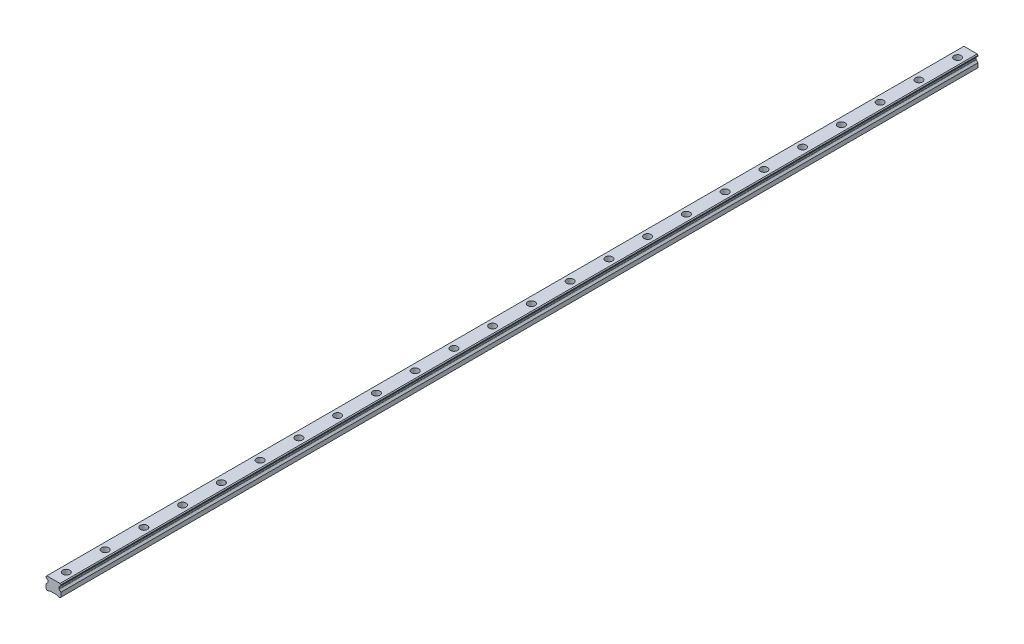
from build123d import *

# Parameters (mm, degrees)
SKETCH1_W           = 23
SKETCH1_H           = 19.2
BOSS_EXTRUDE1_DEPTH = 710
CUT_EXTRUDE1_DEPTH  = 1421.176358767
CHAMFER1_SIZE       = 1.25
FILLET1_R           = 1.25
CUT_EXTRUDE2_DEPTH  = 1421.176358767
SKETCH4_R           = 5.5
SKETCH4_R_2         = 3.5
CUT_EXTRUDE3_DEPTH  = 9
SKETCH4_2_R         = 3.5
CUT_EXTRUDE4_DEPTH  = 711.352651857
LPATTERN1_COUNT     = 24
LPATTERN1_PITCH     = 60


with BuildPart() as part:
    # Sketch1 → Boss-Extrude1 (new, symmetric)
    with BuildSketch(Plane.XY):
        with Locations((0, 9.6)):
            Rectangle(SKETCH1_W, SKETCH1_H)
    extrude(amount=BOSS_EXTRUDE1_DEPTH, both=True)

    # Sketch2 → Cut-Extrude1 (cut, through all)
    with BuildSketch(Plane.XY.offset(710)):
        Polygon((-11.5, 16.7), (-11.5, 7.95), (-8.583333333, 10.866666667), (-8.583333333, 13.783333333), align=None)
        Polygon((8.583333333, 13.783333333), (11.5, 16.7), (11.5, 7.95), (8.583333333, 10.866666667), align=None)
    extrude(amount=-CUT_EXTRUDE1_DEPTH, mode=Mode.SUBTRACT)

    # Chamfer1
    chamfer1_edges = [part.edges().sort_by_distance(p)[0] for p in [
        (-11.5, 19.2, 0),
        (11.5, 19.2, 0),
        (11.5, 0, 0),
        (-11.5, 0, 0),
    ]]
    chamfer(chamfer1_edges, length=CHAMFER1_SIZE)

    # Fillet1
    fillet1_edges = [part.edges().sort_by_distance(p)[0] for p in [
        (-8.583333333, 13.783333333, 0),
        (-8.583333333, 10.866666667, 0),
        (8.583333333, 10.866666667, 0),
        (8.583333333, 13.783333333, 0),
    ]]
    fillet(fillet1_edges, radius=FILLET1_R)

    # Sketch3 → Cut-Extrude2 (cut, through all)
    with BuildSketch(Plane.XY.offset(710)):
        Polygon((-7, 0), (-5.75, 1.25), (5.75, 1.25), (7, 0), align=None)
    extrude(amount=-CUT_EXTRUDE2_DEPTH, mode=Mode.SUBTRACT)

    # Sketch4 → Cut-Extrude3 (cut)
    with BuildSketch(Plane(origin=(0, 19.2, 0), x_dir=(1, 0, 0), z_dir=(0, 1, 0))):
        with Locations(Location((0, -690, 0), (0, 0, 270))):
            Circle(SKETCH4_R)
        with Locations(Location((0, -690, 0), (0, 0, 270))):
            Circle(SKETCH4_R_2, mode=Mode.SUBTRACT)
    cut_extrude3 = extrude(amount=-CUT_EXTRUDE3_DEPTH, mode=Mode.SUBTRACT)

    # Sketch4_2 → Cut-Extrude4 (cut, through all)
    with BuildSketch(Plane(origin=(0, 19.2, 0), x_dir=(1, 0, 0), z_dir=(0, 1, 0))):
        with Locations(Location((0, -690, 0), (0, 0, 270))):
            Circle(SKETCH4_2_R)
    cut_extrude4 = extrude(amount=-CUT_EXTRUDE4_DEPTH, mode=Mode.SUBTRACT)

    # LPattern1: Cut-Extrude3, Cut-Extrude4 ×24
    with Locations(*[(0, 0, -i * LPATTERN1_PITCH) for i in range(1, LPATTERN1_COUNT)]):
        add(cut_extrude3, mode=Mode.SUBTRACT)
        add(cut_extrude4, mode=Mode.SUBTRACT)


solid = part.part
